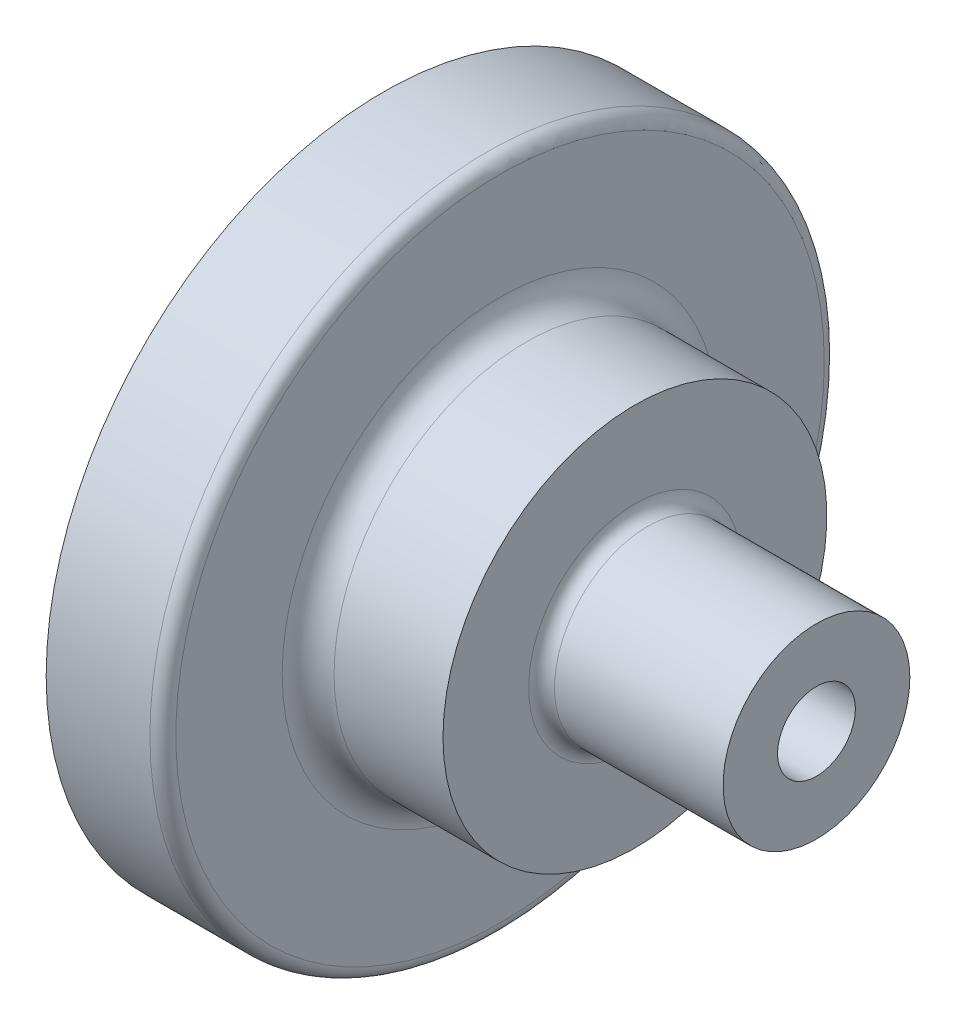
from build123d import *

# Parameters (mm, degrees)
SCHIZZO1_R                   = 130
ESTRUSIONE_ESTRUSIONE1_DEPTH = 45
SCHIZZO3_R                   = 98
SCHIZZO3_R_2                 = 85
ESTRUSIONE_ESTRUSIONE2_DEPTH = 6
RACCORDO1_R                  = 5
SCHIZZO8_R                   = 74
ESTRUSIONE_ESTRUSIONE3_DEPTH = 52
RACCORDO2_R                  = 10
SCHIZZO9_R                   = 36
ESTRUSIONE_ESTRUSIONE4_DEPTH = 70
RACCORDO4_R                  = 5
SKETCH1_R                    = 15
CUT_EXTRUDE1_DEPTH           = 253.446033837


with BuildPart() as part:
    # Schizzo1 → Estrusione-Estrusione1 (new body)
    with BuildSketch(Plane(origin=(0, 0, 0), x_dir=(0, 0, -1), z_dir=(1, 0, 0))):
        with Locations(Location((0, 0, 0), (0, 0, 180))):
            Circle(SCHIZZO1_R)
    extrude(amount=ESTRUSIONE_ESTRUSIONE1_DEPTH)

    # Schizzo3 → Estrusione-Estrusione2 (add)
    with BuildSketch(Plane.ZY):
        with Locations(Location((0, 0, 0), (0, 0, 180))):
            Circle(SCHIZZO3_R)
        Circle(SCHIZZO3_R_2, mode=Mode.SUBTRACT)
    extrude(amount=ESTRUSIONE_ESTRUSIONE2_DEPTH)

    # Raccordo1
    raccordo1_edges = [part.edges().sort_by_distance(p)[0] for p in [
        (45, 0, -130),
    ]]
    fillet(raccordo1_edges, radius=RACCORDO1_R)

    # Schizzo8 → Estrusione-Estrusione3 (add)
    with BuildSketch(Plane(origin=(45, 0, 0), x_dir=(0, 0, -1), z_dir=(1, 0, 0))):
        with Locations(Location((0, 0, 0), (0, 0, 180))):
            Circle(SCHIZZO8_R)
    extrude(amount=ESTRUSIONE_ESTRUSIONE3_DEPTH)

    # Raccordo2
    raccordo2_edges = [part.edges().sort_by_distance(p)[0] for p in [
        (45, 0, -74),
    ]]
    fillet(raccordo2_edges, radius=RACCORDO2_R)

    # Schizzo9 → Estrusione-Estrusione4 (add)
    with BuildSketch(Plane(origin=(97, 0, 0), x_dir=(0, 0, -1), z_dir=(1, 0, 0))):
        Circle(SCHIZZO9_R)
    extrude(amount=ESTRUSIONE_ESTRUSIONE4_DEPTH)

    # Raccordo4
    raccordo4_edges = [part.edges().sort_by_distance(p)[0] for p in [
        (97, 0, 36),
    ]]
    fillet(raccordo4_edges, radius=RACCORDO4_R)

    # Sketch1 → Cut-Extrude1 (cut, through all)
    with BuildSketch(Plane(origin=(167, 0, 0), x_dir=(0, 0, -1), z_dir=(1, 0, 0))):
        Circle(SKETCH1_R)
    extrude(amount=-CUT_EXTRUDE1_DEPTH, mode=Mode.SUBTRACT)


solid = part.part
